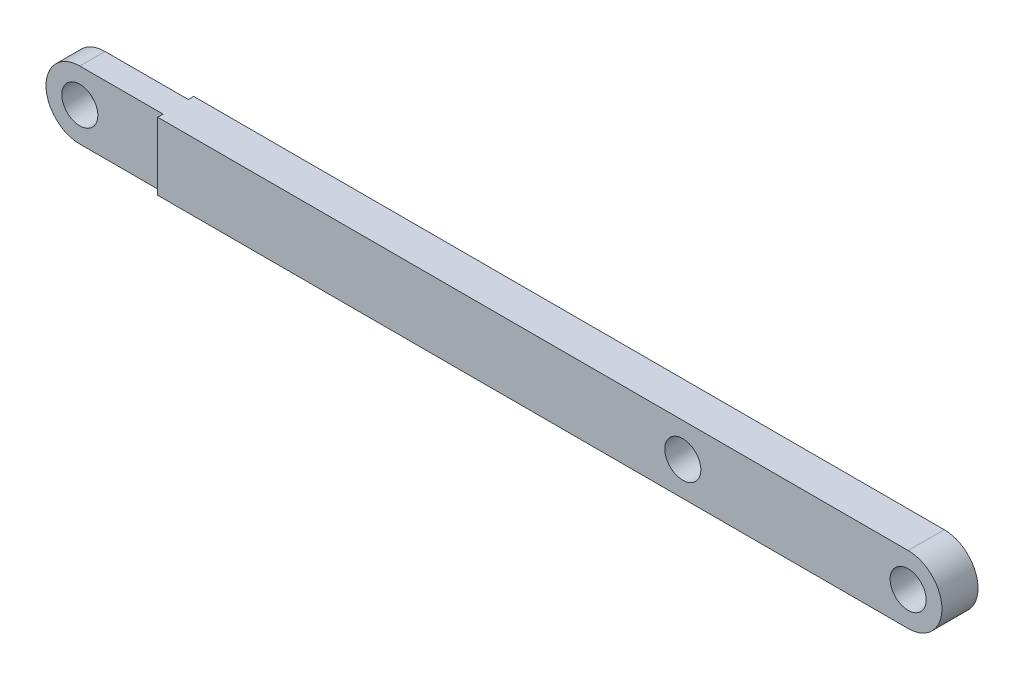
ISO-10303-21;
HEADER;
FILE_DESCRIPTION(('STEP AP214'),'2;1');
FILE_NAME('part.step','',(''),(''),'','','');
FILE_SCHEMA(('AUTOMOTIVE_DESIGN { 1 0 10303 214 1 1 1 1 }'));
ENDSEC;
DATA;
#1=APPLICATION_CONTEXT('core data for automotive mechanical design processes');
#2=APPLICATION_PROTOCOL_DEFINITION('international standard','automotive_design',2000,#1);
#3=PRODUCT_CONTEXT('',#1,'mechanical');
#4=PRODUCT('Part','Part','',(#3));
#5=PRODUCT_RELATED_PRODUCT_CATEGORY('part','',(#4));
#6=PRODUCT_DEFINITION_FORMATION('','',#4);
#7=PRODUCT_DEFINITION_CONTEXT('part definition',#1,'design');
#8=PRODUCT_DEFINITION('design','',#6,#7);
#9=PRODUCT_DEFINITION_SHAPE('','',#8);
#10=(LENGTH_UNIT() NAMED_UNIT(*) SI_UNIT(.MILLI.,.METRE.));
#11=(NAMED_UNIT(*) PLANE_ANGLE_UNIT() SI_UNIT($,.RADIAN.));
#12=(NAMED_UNIT(*) SI_UNIT($,.STERADIAN.) SOLID_ANGLE_UNIT());
#13=UNCERTAINTY_MEASURE_WITH_UNIT(LENGTH_MEASURE(1.E-05),#10,'distance_accuracy_value','');
#14=(GEOMETRIC_REPRESENTATION_CONTEXT(3) GLOBAL_UNCERTAINTY_ASSIGNED_CONTEXT((#13)) GLOBAL_UNIT_ASSIGNED_CONTEXT((#10,
#11,#12)) REPRESENTATION_CONTEXT('',''));
#15=CARTESIAN_POINT('',(0.,0.,0.));
#16=DIRECTION('',(0.,0.,1.));
#17=DIRECTION('',(1.,0.,0.));
#18=AXIS2_PLACEMENT_3D('',#15,#16,#17);
#19=CARTESIAN_POINT('',(-88.4782608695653,0.,8.));
#20=DIRECTION('',(0.,0.,1.));
#21=DIRECTION('',(1.,0.,0.));
#22=AXIS2_PLACEMENT_3D('',#19,#20,#21);
#23=PLANE('',#22);
#24=CARTESIAN_POINT('',(46.5217391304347,0.,8.));
#25=DIRECTION('',(0.,0.,1.));
#26=DIRECTION('',(1.,0.,0.));
#27=AXIS2_PLACEMENT_3D('',#24,#25,#26);
#28=CIRCLE('',#27,4.00000000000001);
#29=CARTESIAN_POINT('',(50.5217391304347,0.,8.));
#30=VERTEX_POINT('',#29);
#31=EDGE_CURVE('E167',#30,#30,#28,.T.);
#32=ORIENTED_EDGE('',*,*,#31,.F.);
#33=EDGE_LOOP('',(#32));
#34=FACE_BOUND('',#33,.T.);
#35=CARTESIAN_POINT('',(96.5217391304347,0.,8.));
#36=DIRECTION('',(0.,0.,1.));
#37=DIRECTION('',(1.,0.,0.));
#38=AXIS2_PLACEMENT_3D('',#35,#36,#37);
#39=CIRCLE('',#38,4.00000000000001);
#40=CARTESIAN_POINT('',(100.521739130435,0.,8.));
#41=VERTEX_POINT('',#40);
#42=EDGE_CURVE('E175',#41,#41,#39,.T.);
#43=ORIENTED_EDGE('',*,*,#42,.F.);
#44=EDGE_LOOP('',(#43));
#45=FACE_BOUND('',#44,.T.);
#46=DIRECTION('',(-1.,0.,0.));
#47=VECTOR('',#46,1.);
#48=CARTESIAN_POINT('',(-88.4782608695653,7.5,8.));
#49=LINE('',#48,#47);
#50=CARTESIAN_POINT('',(96.5217391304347,7.5,8.));
#51=VERTEX_POINT('',#50);
#52=CARTESIAN_POINT('',(-70.,7.5,8.));
#53=VERTEX_POINT('',#52);
#54=EDGE_CURVE('E190',#51,#53,#49,.T.);
#55=ORIENTED_EDGE('',*,*,#54,.T.);
#56=DIRECTION('',(0.,-1.,0.));
#57=VECTOR('',#56,1.);
#58=CARTESIAN_POINT('',(-70.,7.5,8.));
#59=LINE('',#58,#57);
#60=CARTESIAN_POINT('',(-70.,-7.5,8.));
#61=VERTEX_POINT('',#60);
#62=EDGE_CURVE('E65',#53,#61,#59,.T.);
#63=ORIENTED_EDGE('',*,*,#62,.T.);
#64=DIRECTION('',(1.,0.,0.));
#65=VECTOR('',#64,1.);
#66=CARTESIAN_POINT('',(-88.4782608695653,-7.5,8.));
#67=LINE('',#66,#65);
#68=CARTESIAN_POINT('',(96.5217391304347,-7.5,8.));
#69=VERTEX_POINT('',#68);
#70=EDGE_CURVE('E183',#61,#69,#67,.T.);
#71=ORIENTED_EDGE('',*,*,#70,.T.);
#72=CARTESIAN_POINT('',(96.5217391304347,0.,8.));
#73=DIRECTION('',(0.,0.,1.));
#74=DIRECTION('',(1.,0.,0.));
#75=AXIS2_PLACEMENT_3D('',#72,#73,#74);
#76=CIRCLE('',#75,7.5);
#77=EDGE_CURVE('E186',#69,#51,#76,.T.);
#78=ORIENTED_EDGE('',*,*,#77,.T.);
#79=EDGE_LOOP('',(#55,#63,#71,#78));
#80=FACE_BOUND('',#79,.T.);
#81=ADVANCED_FACE('F39',(#34,#45,#80),#23,.T.);
#82=CARTESIAN_POINT('',(-88.4782608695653,0.,0.));
#83=DIRECTION('',(0.,0.,1.));
#84=DIRECTION('',(1.,0.,0.));
#85=AXIS2_PLACEMENT_3D('',#82,#83,#84);
#86=PLANE('',#85);
#87=DIRECTION('',(1.,0.,0.));
#88=VECTOR('',#87,1.);
#89=CARTESIAN_POINT('',(-88.4782608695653,-7.5,0.));
#90=LINE('',#89,#88);
#91=CARTESIAN_POINT('',(-70.,-7.5,0.));
#92=VERTEX_POINT('',#91);
#93=CARTESIAN_POINT('',(96.5217391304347,-7.5,0.));
#94=VERTEX_POINT('',#93);
#95=EDGE_CURVE('E179',#92,#94,#90,.T.);
#96=ORIENTED_EDGE('',*,*,#95,.F.);
#97=DIRECTION('',(0.,1.,0.));
#98=VECTOR('',#97,1.);
#99=CARTESIAN_POINT('',(-70.,7.5,0.));
#100=LINE('',#99,#98);
#101=CARTESIAN_POINT('',(-70.,7.5,0.));
#102=VERTEX_POINT('',#101);
#103=EDGE_CURVE('E145',#92,#102,#100,.T.);
#104=ORIENTED_EDGE('',*,*,#103,.T.);
#105=DIRECTION('',(-1.,0.,0.));
#106=VECTOR('',#105,1.);
#107=CARTESIAN_POINT('',(-88.4782608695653,7.5,0.));
#108=LINE('',#107,#106);
#109=CARTESIAN_POINT('',(96.5217391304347,7.5,0.));
#110=VERTEX_POINT('',#109);
#111=EDGE_CURVE('E187',#110,#102,#108,.T.);
#112=ORIENTED_EDGE('',*,*,#111,.F.);
#113=CARTESIAN_POINT('',(96.5217391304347,0.,0.));
#114=DIRECTION('',(0.,0.,1.));
#115=DIRECTION('',(1.,0.,0.));
#116=AXIS2_PLACEMENT_3D('',#113,#114,#115);
#117=CIRCLE('',#116,7.5);
#118=EDGE_CURVE('E195',#94,#110,#117,.T.);
#119=ORIENTED_EDGE('',*,*,#118,.F.);
#120=EDGE_LOOP('',(#96,#104,#112,#119));
#121=FACE_BOUND('',#120,.T.);
#122=CARTESIAN_POINT('',(96.5217391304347,0.,0.));
#123=DIRECTION('',(0.,0.,1.));
#124=DIRECTION('',(1.,0.,0.));
#125=AXIS2_PLACEMENT_3D('',#122,#123,#124);
#126=CIRCLE('',#125,4.00000000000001);
#127=CARTESIAN_POINT('',(100.521739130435,0.,0.));
#128=VERTEX_POINT('',#127);
#129=EDGE_CURVE('E171',#128,#128,#126,.T.);
#130=ORIENTED_EDGE('',*,*,#129,.T.);
#131=EDGE_LOOP('',(#130));
#132=FACE_BOUND('',#131,.T.);
#133=CARTESIAN_POINT('',(46.5217391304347,0.,0.));
#134=DIRECTION('',(0.,0.,1.));
#135=DIRECTION('',(1.,0.,0.));
#136=AXIS2_PLACEMENT_3D('',#133,#134,#135);
#137=CIRCLE('',#136,4.00000000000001);
#138=CARTESIAN_POINT('',(50.5217391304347,0.,0.));
#139=VERTEX_POINT('',#138);
#140=EDGE_CURVE('E166',#139,#139,#137,.T.);
#141=ORIENTED_EDGE('',*,*,#140,.T.);
#142=EDGE_LOOP('',(#141));
#143=FACE_BOUND('',#142,.T.);
#144=ADVANCED_FACE('F228',(#121,#132,#143),#86,.F.);
#145=CARTESIAN_POINT('',(-88.4782608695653,0.,8.));
#146=DIRECTION('',(0.,0.,-1.));
#147=DIRECTION('',(-1.,0.,0.));
#148=AXIS2_PLACEMENT_3D('',#145,#146,#147);
#149=CYLINDRICAL_SURFACE('',#148,7.5);
#150=DIRECTION('',(0.,0.,-1.));
#151=VECTOR('',#150,1.);
#152=CARTESIAN_POINT('',(-88.4782608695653,-7.5,8.));
#153=LINE('',#152,#151);
#154=CARTESIAN_POINT('',(-88.4782608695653,-7.5,6.8));
#155=VERTEX_POINT('',#154);
#156=CARTESIAN_POINT('',(-88.4782608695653,-7.5,1.2));
#157=VERTEX_POINT('',#156);
#158=EDGE_CURVE('E11',#155,#157,#153,.T.);
#159=ORIENTED_EDGE('',*,*,#158,.F.);
#160=CARTESIAN_POINT('',(-88.4782608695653,0.,6.8));
#161=DIRECTION('',(0.,0.,-1.));
#162=DIRECTION('',(0.,1.,0.));
#163=AXIS2_PLACEMENT_3D('',#160,#161,#162);
#164=CIRCLE('',#163,7.5);
#165=CARTESIAN_POINT('',(-88.4782608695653,7.5,6.8));
#166=VERTEX_POINT('',#165);
#167=EDGE_CURVE('E163',#155,#166,#164,.T.);
#168=ORIENTED_EDGE('',*,*,#167,.T.);
#169=DIRECTION('',(0.,0.,-1.));
#170=VECTOR('',#169,1.);
#171=CARTESIAN_POINT('',(-88.4782608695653,7.5,8.));
#172=LINE('',#171,#170);
#173=CARTESIAN_POINT('',(-88.4782608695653,7.5,1.2));
#174=VERTEX_POINT('',#173);
#175=EDGE_CURVE('E129',#166,#174,#172,.T.);
#176=ORIENTED_EDGE('',*,*,#175,.T.);
#177=CARTESIAN_POINT('',(-88.4782608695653,0.,1.2));
#178=DIRECTION('',(0.,0.,1.));
#179=DIRECTION('',(0.,-1.,0.));
#180=AXIS2_PLACEMENT_3D('',#177,#178,#179);
#181=CIRCLE('',#180,7.5);
#182=EDGE_CURVE('E159',#174,#157,#181,.T.);
#183=ORIENTED_EDGE('',*,*,#182,.T.);
#184=EDGE_LOOP('',(#159,#168,#176,#183));
#185=FACE_BOUND('',#184,.T.);
#186=ADVANCED_FACE('F41',(#185),#149,.T.);
#187=CARTESIAN_POINT('',(-88.4782608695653,-7.5,8.));
#188=DIRECTION('',(0.,1.,0.));
#189=DIRECTION('',(0.,0.,1.));
#190=AXIS2_PLACEMENT_3D('',#187,#188,#189);
#191=PLANE('',#190);
#192=DIRECTION('',(0.,0.,-1.));
#193=VECTOR('',#192,1.);
#194=CARTESIAN_POINT('',(-70.,-7.5,6.8));
#195=LINE('',#194,#193);
#196=CARTESIAN_POINT('',(-70.,-7.5,6.8));
#197=VERTEX_POINT('',#196);
#198=EDGE_CURVE('E131',#61,#197,#195,.T.);
#199=ORIENTED_EDGE('',*,*,#198,.T.);
#200=DIRECTION('',(1.,0.,0.));
#201=VECTOR('',#200,1.);
#202=CARTESIAN_POINT('',(-101.,-7.5,6.8));
#203=LINE('',#202,#201);
#204=EDGE_CURVE('E121',#155,#197,#203,.T.);
#205=ORIENTED_EDGE('',*,*,#204,.F.);
#206=ORIENTED_EDGE('',*,*,#158,.T.);
#207=DIRECTION('',(1.,0.,0.));
#208=VECTOR('',#207,1.);
#209=CARTESIAN_POINT('',(-101.,-7.5,1.2));
#210=LINE('',#209,#208);
#211=CARTESIAN_POINT('',(-70.,-7.5,1.2));
#212=VERTEX_POINT('',#211);
#213=EDGE_CURVE('E153',#157,#212,#210,.T.);
#214=ORIENTED_EDGE('',*,*,#213,.T.);
#215=DIRECTION('',(0.,0.,-1.));
#216=VECTOR('',#215,1.);
#217=CARTESIAN_POINT('',(-70.,-7.5,1.2));
#218=LINE('',#217,#216);
#219=EDGE_CURVE('E141',#212,#92,#218,.T.);
#220=ORIENTED_EDGE('',*,*,#219,.T.);
#221=ORIENTED_EDGE('',*,*,#95,.T.);
#222=DIRECTION('',(0.,0.,-1.));
#223=VECTOR('',#222,1.);
#224=CARTESIAN_POINT('',(96.5217391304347,-7.5,8.));
#225=LINE('',#224,#223);
#226=EDGE_CURVE('E49',#69,#94,#225,.T.);
#227=ORIENTED_EDGE('',*,*,#226,.F.);
#228=ORIENTED_EDGE('',*,*,#70,.F.);
#229=EDGE_LOOP('',(#199,#205,#206,#214,#220,#221,#227,#228));
#230=FACE_BOUND('',#229,.T.);
#231=ADVANCED_FACE('F243',(#230),#191,.F.);
#232=CARTESIAN_POINT('',(96.5217391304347,0.,8.));
#233=DIRECTION('',(0.,0.,-1.));
#234=DIRECTION('',(-1.,0.,0.));
#235=AXIS2_PLACEMENT_3D('',#232,#233,#234);
#236=CYLINDRICAL_SURFACE('',#235,7.5);
#237=ORIENTED_EDGE('',*,*,#118,.T.);
#238=DIRECTION('',(0.,0.,-1.));
#239=VECTOR('',#238,1.);
#240=CARTESIAN_POINT('',(96.5217391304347,7.5,8.));
#241=LINE('',#240,#239);
#242=EDGE_CURVE('E203',#51,#110,#241,.T.);
#243=ORIENTED_EDGE('',*,*,#242,.F.);
#244=ORIENTED_EDGE('',*,*,#77,.F.);
#245=ORIENTED_EDGE('',*,*,#226,.T.);
#246=EDGE_LOOP('',(#237,#243,#244,#245));
#247=FACE_BOUND('',#246,.T.);
#248=ADVANCED_FACE('F241',(#247),#236,.T.);
#249=CARTESIAN_POINT('',(-88.4782608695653,7.5,8.));
#250=DIRECTION('',(0.,-1.,0.));
#251=DIRECTION('',(0.,0.,-1.));
#252=AXIS2_PLACEMENT_3D('',#249,#250,#251);
#253=PLANE('',#252);
#254=ORIENTED_EDGE('',*,*,#175,.F.);
#255=DIRECTION('',(1.,0.,0.));
#256=VECTOR('',#255,1.);
#257=CARTESIAN_POINT('',(-101.,7.5,6.8));
#258=LINE('',#257,#256);
#259=CARTESIAN_POINT('',(-70.,7.5,6.8));
#260=VERTEX_POINT('',#259);
#261=EDGE_CURVE('E118',#166,#260,#258,.T.);
#262=ORIENTED_EDGE('',*,*,#261,.T.);
#263=DIRECTION('',(0.,0.,1.));
#264=VECTOR('',#263,1.);
#265=CARTESIAN_POINT('',(-70.,7.5,6.8));
#266=LINE('',#265,#264);
#267=EDGE_CURVE('E105',#260,#53,#266,.T.);
#268=ORIENTED_EDGE('',*,*,#267,.T.);
#269=ORIENTED_EDGE('',*,*,#54,.F.);
#270=ORIENTED_EDGE('',*,*,#242,.T.);
#271=ORIENTED_EDGE('',*,*,#111,.T.);
#272=DIRECTION('',(0.,0.,1.));
#273=VECTOR('',#272,1.);
#274=CARTESIAN_POINT('',(-70.,7.5,1.2));
#275=LINE('',#274,#273);
#276=CARTESIAN_POINT('',(-70.,7.5,1.2));
#277=VERTEX_POINT('',#276);
#278=EDGE_CURVE('E149',#102,#277,#275,.T.);
#279=ORIENTED_EDGE('',*,*,#278,.T.);
#280=DIRECTION('',(1.,0.,0.));
#281=VECTOR('',#280,1.);
#282=CARTESIAN_POINT('',(-101.,7.5,1.2));
#283=LINE('',#282,#281);
#284=EDGE_CURVE('E123',#174,#277,#283,.T.);
#285=ORIENTED_EDGE('',*,*,#284,.F.);
#286=EDGE_LOOP('',(#254,#262,#268,#269,#270,#271,#279,#285));
#287=FACE_BOUND('',#286,.T.);
#288=ADVANCED_FACE('F126',(#287),#253,.F.);
#289=CARTESIAN_POINT('',(96.5217391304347,0.,8.));
#290=DIRECTION('',(0.,0.,-1.));
#291=DIRECTION('',(-1.,0.,0.));
#292=AXIS2_PLACEMENT_3D('',#289,#290,#291);
#293=CYLINDRICAL_SURFACE('',#292,4.00000000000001);
#294=ORIENTED_EDGE('',*,*,#42,.T.);
#295=EDGE_LOOP('',(#294));
#296=FACE_BOUND('',#295,.T.);
#297=ORIENTED_EDGE('',*,*,#129,.F.);
#298=EDGE_LOOP('',(#297));
#299=FACE_BOUND('',#298,.T.);
#300=ADVANCED_FACE('F240',(#296,#299),#293,.F.);
#301=CARTESIAN_POINT('',(46.5217391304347,0.,8.));
#302=DIRECTION('',(0.,0.,-1.));
#303=DIRECTION('',(-1.,0.,0.));
#304=AXIS2_PLACEMENT_3D('',#301,#302,#303);
#305=CYLINDRICAL_SURFACE('',#304,4.00000000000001);
#306=ORIENTED_EDGE('',*,*,#31,.T.);
#307=EDGE_LOOP('',(#306));
#308=FACE_BOUND('',#307,.T.);
#309=ORIENTED_EDGE('',*,*,#140,.F.);
#310=EDGE_LOOP('',(#309));
#311=FACE_BOUND('',#310,.T.);
#312=ADVANCED_FACE('F265',(#308,#311),#305,.F.);
#313=CARTESIAN_POINT('',(-101.,7.5,1.2));
#314=DIRECTION('',(0.,0.,1.));
#315=DIRECTION('',(0.,-1.,0.));
#316=AXIS2_PLACEMENT_3D('',#313,#314,#315);
#317=PLANE('',#316);
#318=CARTESIAN_POINT('',(-88.4782608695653,0.,1.2));
#319=DIRECTION('',(0.,0.,1.));
#320=DIRECTION('',(0.,-1.,0.));
#321=AXIS2_PLACEMENT_3D('',#318,#319,#320);
#322=CIRCLE('',#321,4.00000000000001);
#323=CARTESIAN_POINT('',(-88.4782608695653,-4.00000000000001,1.2));
#324=VERTEX_POINT('',#323);
#325=EDGE_CURVE('E135',#324,#324,#322,.T.);
#326=ORIENTED_EDGE('',*,*,#325,.T.);
#327=EDGE_LOOP('',(#326));
#328=FACE_BOUND('',#327,.T.);
#329=ORIENTED_EDGE('',*,*,#284,.T.);
#330=DIRECTION('',(0.,-1.,0.));
#331=VECTOR('',#330,1.);
#332=CARTESIAN_POINT('',(-70.,7.5,1.2));
#333=LINE('',#332,#331);
#334=EDGE_CURVE('E57',#277,#212,#333,.T.);
#335=ORIENTED_EDGE('',*,*,#334,.T.);
#336=ORIENTED_EDGE('',*,*,#213,.F.);
#337=ORIENTED_EDGE('',*,*,#182,.F.);
#338=EDGE_LOOP('',(#329,#335,#336,#337));
#339=FACE_BOUND('',#338,.T.);
#340=ADVANCED_FACE('F213',(#328,#339),#317,.F.);
#341=CARTESIAN_POINT('',(-70.,0.,0.));
#342=DIRECTION('',(1.,0.,0.));
#343=DIRECTION('',(0.,0.,-1.));
#344=AXIS2_PLACEMENT_3D('',#341,#342,#343);
#345=PLANE('',#344);
#346=ORIENTED_EDGE('',*,*,#334,.F.);
#347=ORIENTED_EDGE('',*,*,#278,.F.);
#348=ORIENTED_EDGE('',*,*,#103,.F.);
#349=ORIENTED_EDGE('',*,*,#219,.F.);
#350=EDGE_LOOP('',(#346,#347,#348,#349));
#351=FACE_BOUND('',#350,.T.);
#352=ADVANCED_FACE('F263',(#351),#345,.F.);
#353=CARTESIAN_POINT('',(-101.,7.5,6.8));
#354=DIRECTION('',(0.,0.,-1.));
#355=DIRECTION('',(0.,1.,0.));
#356=AXIS2_PLACEMENT_3D('',#353,#354,#355);
#357=PLANE('',#356);
#358=CARTESIAN_POINT('',(-88.4782608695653,0.,6.8));
#359=DIRECTION('',(0.,0.,-1.));
#360=DIRECTION('',(0.,1.,0.));
#361=AXIS2_PLACEMENT_3D('',#358,#359,#360);
#362=CIRCLE('',#361,4.00000000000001);
#363=CARTESIAN_POINT('',(-88.4782608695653,4.00000000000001,6.8));
#364=VERTEX_POINT('',#363);
#365=EDGE_CURVE('E43',#364,#364,#362,.T.);
#366=ORIENTED_EDGE('',*,*,#365,.T.);
#367=EDGE_LOOP('',(#366));
#368=FACE_BOUND('',#367,.T.);
#369=ORIENTED_EDGE('',*,*,#204,.T.);
#370=DIRECTION('',(0.,1.,0.));
#371=VECTOR('',#370,1.);
#372=CARTESIAN_POINT('',(-70.,7.5,6.8));
#373=LINE('',#372,#371);
#374=EDGE_CURVE('E108',#197,#260,#373,.T.);
#375=ORIENTED_EDGE('',*,*,#374,.T.);
#376=ORIENTED_EDGE('',*,*,#261,.F.);
#377=ORIENTED_EDGE('',*,*,#167,.F.);
#378=EDGE_LOOP('',(#369,#375,#376,#377));
#379=FACE_BOUND('',#378,.T.);
#380=ADVANCED_FACE('F117',(#368,#379),#357,.F.);
#381=CARTESIAN_POINT('',(-70.,0.,0.));
#382=DIRECTION('',(-1.,0.,0.));
#383=DIRECTION('',(0.,0.,1.));
#384=AXIS2_PLACEMENT_3D('',#381,#382,#383);
#385=PLANE('',#384);
#386=ORIENTED_EDGE('',*,*,#374,.F.);
#387=ORIENTED_EDGE('',*,*,#198,.F.);
#388=ORIENTED_EDGE('',*,*,#62,.F.);
#389=ORIENTED_EDGE('',*,*,#267,.F.);
#390=EDGE_LOOP('',(#386,#387,#388,#389));
#391=FACE_BOUND('',#390,.T.);
#392=ADVANCED_FACE('F107',(#391),#385,.T.);
#393=CARTESIAN_POINT('',(-88.4782608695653,0.,8.));
#394=DIRECTION('',(0.,0.,-1.));
#395=DIRECTION('',(-1.,0.,0.));
#396=AXIS2_PLACEMENT_3D('',#393,#394,#395);
#397=CYLINDRICAL_SURFACE('',#396,4.00000000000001);
#398=ORIENTED_EDGE('',*,*,#365,.F.);
#399=EDGE_LOOP('',(#398));
#400=FACE_BOUND('',#399,.T.);
#401=ORIENTED_EDGE('',*,*,#325,.F.);
#402=EDGE_LOOP('',(#401));
#403=FACE_BOUND('',#402,.T.);
#404=ADVANCED_FACE('F216',(#400,#403),#397,.F.);
#405=CLOSED_SHELL('',(#81,#144,#186,#231,#248,#288,#300,#312,#340,#352,#380,#392,#404));
#406=MANIFOLD_SOLID_BREP('B2',#405);
#407=ADVANCED_BREP_SHAPE_REPRESENTATION('',(#18,#406),#14);
#408=SHAPE_DEFINITION_REPRESENTATION(#9,#407);
ENDSEC;
END-ISO-10303-21;
